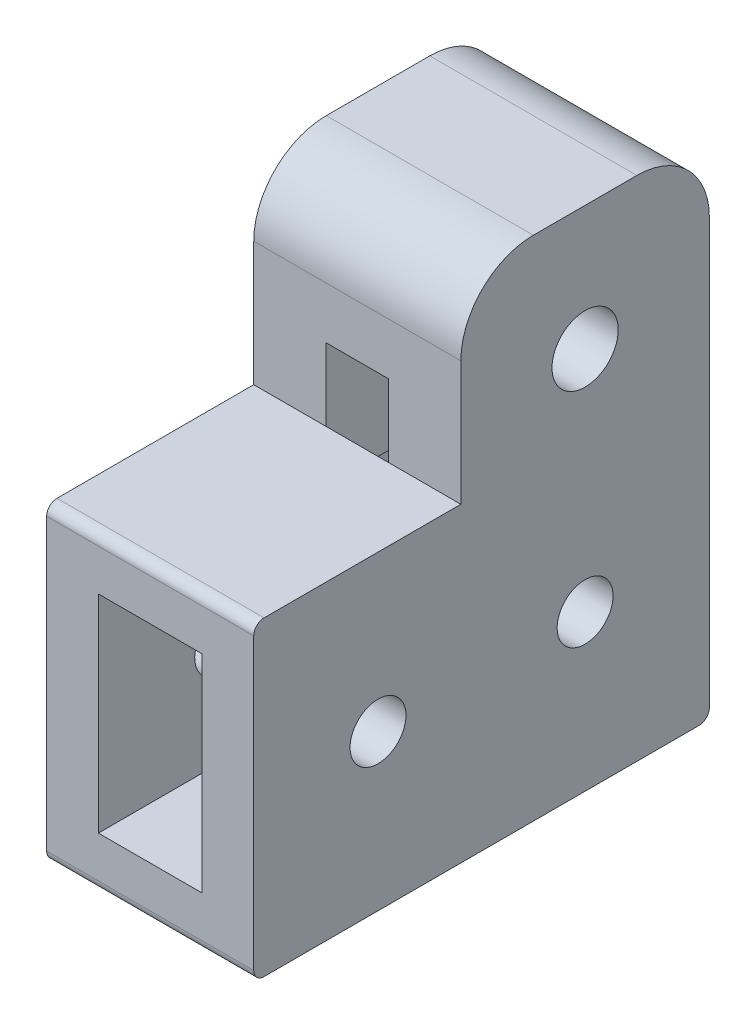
ISO-10303-21;
HEADER;
FILE_DESCRIPTION(('STEP AP214'),'2;1');
FILE_NAME('part.step','',(''),(''),'','','');
FILE_SCHEMA(('AUTOMOTIVE_DESIGN { 1 0 10303 214 1 1 1 1 }'));
ENDSEC;
DATA;
#1=APPLICATION_CONTEXT('core data for automotive mechanical design processes');
#2=APPLICATION_PROTOCOL_DEFINITION('international standard','automotive_design',2000,#1);
#3=PRODUCT_CONTEXT('',#1,'mechanical');
#4=PRODUCT('Part','Part','',(#3));
#5=PRODUCT_RELATED_PRODUCT_CATEGORY('part','',(#4));
#6=PRODUCT_DEFINITION_FORMATION('','',#4);
#7=PRODUCT_DEFINITION_CONTEXT('part definition',#1,'design');
#8=PRODUCT_DEFINITION('design','',#6,#7);
#9=PRODUCT_DEFINITION_SHAPE('','',#8);
#10=(LENGTH_UNIT() NAMED_UNIT(*) SI_UNIT(.MILLI.,.METRE.));
#11=(NAMED_UNIT(*) PLANE_ANGLE_UNIT() SI_UNIT($,.RADIAN.));
#12=(NAMED_UNIT(*) SI_UNIT($,.STERADIAN.) SOLID_ANGLE_UNIT());
#13=UNCERTAINTY_MEASURE_WITH_UNIT(LENGTH_MEASURE(1.E-05),#10,'distance_accuracy_value','');
#14=(GEOMETRIC_REPRESENTATION_CONTEXT(3) GLOBAL_UNCERTAINTY_ASSIGNED_CONTEXT((#13)) GLOBAL_UNIT_ASSIGNED_CONTEXT((#10,
#11,#12)) REPRESENTATION_CONTEXT('',''));
#15=CARTESIAN_POINT('',(0.,0.,0.));
#16=DIRECTION('',(0.,0.,1.));
#17=DIRECTION('',(1.,0.,0.));
#18=AXIS2_PLACEMENT_3D('',#15,#16,#17);
#19=CARTESIAN_POINT('',(10.,-23.,-24.));
#20=DIRECTION('',(0.,0.,1.));
#21=DIRECTION('',(1.,0.,0.));
#22=AXIS2_PLACEMENT_3D('',#19,#20,#21);
#23=PLANE('',#22);
#24=DIRECTION('',(0.,1.,0.));
#25=VECTOR('',#24,1.);
#26=CARTESIAN_POINT('',(10.,-23.,-24.));
#27=LINE('',#26,#25);
#28=CARTESIAN_POINT('',(10.,-22.,-24.));
#29=VERTEX_POINT('',#28);
#30=CARTESIAN_POINT('',(10.,19.,-24.));
#31=VERTEX_POINT('',#30);
#32=EDGE_CURVE('E582',#29,#31,#27,.T.);
#33=ORIENTED_EDGE('',*,*,#32,.F.);
#34=DIRECTION('',(-1.,0.,0.));
#35=VECTOR('',#34,1.);
#36=CARTESIAN_POINT('',(10.,-22.,-24.));
#37=LINE('',#36,#35);
#38=CARTESIAN_POINT('',(-10.,-22.,-24.));
#39=VERTEX_POINT('',#38);
#40=EDGE_CURVE('E355',#29,#39,#37,.T.);
#41=ORIENTED_EDGE('',*,*,#40,.T.);
#42=DIRECTION('',(0.,1.,0.));
#43=VECTOR('',#42,1.);
#44=CARTESIAN_POINT('',(-10.,-23.,-24.));
#45=LINE('',#44,#43);
#46=CARTESIAN_POINT('',(-10.,19.,-24.));
#47=VERTEX_POINT('',#46);
#48=EDGE_CURVE('E414',#39,#47,#45,.T.);
#49=ORIENTED_EDGE('',*,*,#48,.T.);
#50=DIRECTION('',(-1.,0.,0.));
#51=VECTOR('',#50,1.);
#52=CARTESIAN_POINT('',(10.,19.,-24.));
#53=LINE('',#52,#51);
#54=EDGE_CURVE('E338',#47,#31,#53,.F.);
#55=ORIENTED_EDGE('',*,*,#54,.T.);
#56=EDGE_LOOP('',(#33,#41,#49,#55));
#57=FACE_BOUND('',#56,.T.);
#58=DIRECTION('',(0.,1.,0.));
#59=VECTOR('',#58,1.);
#60=CARTESIAN_POINT('',(-5.,-18.,-24.));
#61=LINE('',#60,#59);
#62=CARTESIAN_POINT('',(-5.,-18.,-24.));
#63=VERTEX_POINT('',#62);
#64=CARTESIAN_POINT('',(-5.,1.99999999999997,-24.));
#65=VERTEX_POINT('',#64);
#66=EDGE_CURVE('E223',#63,#65,#61,.T.);
#67=ORIENTED_EDGE('',*,*,#66,.F.);
#68=DIRECTION('',(-1.,0.,0.));
#69=VECTOR('',#68,1.);
#70=CARTESIAN_POINT('',(-3.,-18.,-24.));
#71=LINE('',#70,#69);
#72=CARTESIAN_POINT('',(5.,-18.,-24.));
#73=VERTEX_POINT('',#72);
#74=EDGE_CURVE('E277',#73,#63,#71,.T.);
#75=ORIENTED_EDGE('',*,*,#74,.F.);
#76=DIRECTION('',(0.,-1.,0.));
#77=VECTOR('',#76,1.);
#78=CARTESIAN_POINT('',(5.,-18.,-24.));
#79=LINE('',#78,#77);
#80=CARTESIAN_POINT('',(5.,1.99999999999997,-24.));
#81=VERTEX_POINT('',#80);
#82=EDGE_CURVE('E193',#81,#73,#79,.T.);
#83=ORIENTED_EDGE('',*,*,#82,.F.);
#84=DIRECTION('',(1.,0.,0.));
#85=VECTOR('',#84,1.);
#86=CARTESIAN_POINT('',(-5.,1.99999999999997,-24.));
#87=LINE('',#86,#85);
#88=CARTESIAN_POINT('',(3.,1.99999999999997,-24.));
#89=VERTEX_POINT('',#88);
#90=EDGE_CURVE('E216',#89,#81,#87,.T.);
#91=ORIENTED_EDGE('',*,*,#90,.F.);
#92=DIRECTION('',(1.,0.,0.));
#93=VECTOR('',#92,1.);
#94=CARTESIAN_POINT('',(-3.,1.99999999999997,-24.));
#95=LINE('',#94,#93);
#96=CARTESIAN_POINT('',(-3.,1.99999999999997,-24.));
#97=VERTEX_POINT('',#96);
#98=EDGE_CURVE('E269',#97,#89,#95,.T.);
#99=ORIENTED_EDGE('',*,*,#98,.F.);
#100=EDGE_CURVE('E212',#65,#97,#87,.T.);
#101=ORIENTED_EDGE('',*,*,#100,.F.);
#102=EDGE_LOOP('',(#67,#75,#83,#91,#99,#101));
#103=FACE_BOUND('',#102,.T.);
#104=ADVANCED_FACE('F52',(#57,#103),#23,.F.);
#105=CARTESIAN_POINT('',(10.,-8.00000000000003,-12.));
#106=DIRECTION('',(-1.,0.,0.));
#107=DIRECTION('',(0.,0.,1.));
#108=AXIS2_PLACEMENT_3D('',#105,#106,#107);
#109=CYLINDRICAL_SURFACE('',#108,2.7);
#110=CARTESIAN_POINT('',(5.,-8.00000000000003,-12.));
#111=DIRECTION('',(1.,0.,0.));
#112=DIRECTION('',(0.,1.,0.));
#113=AXIS2_PLACEMENT_3D('',#110,#111,#112);
#114=CIRCLE('',#113,2.7);
#115=CARTESIAN_POINT('',(5.,-5.30000000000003,-12.));
#116=VERTEX_POINT('',#115);
#117=EDGE_CURVE('E264',#116,#116,#114,.T.);
#118=ORIENTED_EDGE('',*,*,#117,.F.);
#119=EDGE_LOOP('',(#118));
#120=FACE_BOUND('',#119,.T.);
#121=CARTESIAN_POINT('',(10.,-8.00000000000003,-12.));
#122=DIRECTION('',(1.,0.,0.));
#123=DIRECTION('',(0.,0.,-1.));
#124=AXIS2_PLACEMENT_3D('',#121,#122,#123);
#125=CIRCLE('',#124,2.7);
#126=CARTESIAN_POINT('',(10.,-8.00000000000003,-14.7));
#127=VERTEX_POINT('',#126);
#128=EDGE_CURVE('E797',#127,#127,#125,.T.);
#129=ORIENTED_EDGE('',*,*,#128,.T.);
#130=EDGE_LOOP('',(#129));
#131=FACE_BOUND('',#130,.T.);
#132=ADVANCED_FACE('F474',(#120,#131),#109,.F.);
#133=CARTESIAN_POINT('',(10.,-8.00000000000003,8.));
#134=DIRECTION('',(-1.,0.,0.));
#135=DIRECTION('',(0.,0.,1.));
#136=AXIS2_PLACEMENT_3D('',#133,#134,#135);
#137=CYLINDRICAL_SURFACE('',#136,2.7);
#138=CARTESIAN_POINT('',(5.,-8.00000000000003,8.));
#139=DIRECTION('',(1.,0.,0.));
#140=DIRECTION('',(0.,1.,0.));
#141=AXIS2_PLACEMENT_3D('',#138,#139,#140);
#142=CIRCLE('',#141,2.7);
#143=CARTESIAN_POINT('',(5.,-5.30000000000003,8.));
#144=VERTEX_POINT('',#143);
#145=EDGE_CURVE('E262',#144,#144,#142,.T.);
#146=ORIENTED_EDGE('',*,*,#145,.F.);
#147=EDGE_LOOP('',(#146));
#148=FACE_BOUND('',#147,.T.);
#149=CARTESIAN_POINT('',(10.,-8.00000000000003,8.));
#150=DIRECTION('',(1.,0.,0.));
#151=DIRECTION('',(0.,0.,-1.));
#152=AXIS2_PLACEMENT_3D('',#149,#150,#151);
#153=CIRCLE('',#152,2.7);
#154=CARTESIAN_POINT('',(10.,-8.00000000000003,5.3));
#155=VERTEX_POINT('',#154);
#156=EDGE_CURVE('E407',#155,#155,#153,.T.);
#157=ORIENTED_EDGE('',*,*,#156,.T.);
#158=EDGE_LOOP('',(#157));
#159=FACE_BOUND('',#158,.T.);
#160=ADVANCED_FACE('F465',(#148,#159),#137,.F.);
#161=CARTESIAN_POINT('',(10.,26.,0.));
#162=DIRECTION('',(0.,0.,-1.));
#163=DIRECTION('',(0.,1.,0.));
#164=AXIS2_PLACEMENT_3D('',#161,#162,#163);
#165=PLANE('',#164);
#166=DIRECTION('',(0.,-1.,0.));
#167=VECTOR('',#166,1.);
#168=CARTESIAN_POINT('',(10.,26.,0.));
#169=LINE('',#168,#167);
#170=CARTESIAN_POINT('',(10.,19.,0.));
#171=VERTEX_POINT('',#170);
#172=CARTESIAN_POINT('',(10.,6.99999999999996,0.));
#173=VERTEX_POINT('',#172);
#174=EDGE_CURVE('E595',#171,#173,#169,.T.);
#175=ORIENTED_EDGE('',*,*,#174,.F.);
#176=DIRECTION('',(-1.,0.,0.));
#177=VECTOR('',#176,1.);
#178=CARTESIAN_POINT('',(10.,19.,0.));
#179=LINE('',#178,#177);
#180=CARTESIAN_POINT('',(-10.,19.,0.));
#181=VERTEX_POINT('',#180);
#182=EDGE_CURVE('E278',#171,#181,#179,.T.);
#183=ORIENTED_EDGE('',*,*,#182,.T.);
#184=DIRECTION('',(0.,-1.,0.));
#185=VECTOR('',#184,1.);
#186=CARTESIAN_POINT('',(-10.,26.,0.));
#187=LINE('',#186,#185);
#188=CARTESIAN_POINT('',(-10.,6.99999999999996,0.));
#189=VERTEX_POINT('',#188);
#190=EDGE_CURVE('E426',#181,#189,#187,.T.);
#191=ORIENTED_EDGE('',*,*,#190,.T.);
#192=DIRECTION('',(-1.,0.,0.));
#193=VECTOR('',#192,1.);
#194=CARTESIAN_POINT('',(10.,6.99999999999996,0.));
#195=LINE('',#194,#193);
#196=CARTESIAN_POINT('',(-3.,6.99999999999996,0.));
#197=VERTEX_POINT('',#196);
#198=EDGE_CURVE('E438',#197,#189,#195,.T.);
#199=ORIENTED_EDGE('',*,*,#198,.F.);
#200=DIRECTION('',(0.,-1.,0.));
#201=VECTOR('',#200,1.);
#202=CARTESIAN_POINT('',(-3.,14.,0.));
#203=LINE('',#202,#201);
#204=CARTESIAN_POINT('',(-3.,14.,0.));
#205=VERTEX_POINT('',#204);
#206=EDGE_CURVE('E315',#205,#197,#203,.T.);
#207=ORIENTED_EDGE('',*,*,#206,.F.);
#208=DIRECTION('',(-1.,0.,0.));
#209=VECTOR('',#208,1.);
#210=CARTESIAN_POINT('',(-3.,14.,0.));
#211=LINE('',#210,#209);
#212=CARTESIAN_POINT('',(3.,14.,0.));
#213=VERTEX_POINT('',#212);
#214=EDGE_CURVE('E310',#213,#205,#211,.T.);
#215=ORIENTED_EDGE('',*,*,#214,.F.);
#216=DIRECTION('',(0.,1.,0.));
#217=VECTOR('',#216,1.);
#218=CARTESIAN_POINT('',(3.,14.,0.));
#219=LINE('',#218,#217);
#220=CARTESIAN_POINT('',(3.,6.99999999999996,0.));
#221=VERTEX_POINT('',#220);
#222=EDGE_CURVE('E323',#221,#213,#219,.T.);
#223=ORIENTED_EDGE('',*,*,#222,.F.);
#224=EDGE_CURVE('E328',#173,#221,#195,.T.);
#225=ORIENTED_EDGE('',*,*,#224,.F.);
#226=EDGE_LOOP('',(#175,#183,#191,#199,#207,#215,#223,#225));
#227=FACE_BOUND('',#226,.T.);
#228=ADVANCED_FACE('F455',(#227),#165,.F.);
#229=CARTESIAN_POINT('',(-5.,-8.00000000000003,-12.));
#230=DIRECTION('',(-1.,0.,0.));
#231=DIRECTION('',(0.,-1.,0.));
#232=AXIS2_PLACEMENT_3D('',#229,#230,#231);
#233=CIRCLE('',#232,2.7);
#234=CARTESIAN_POINT('',(-5.,-10.7,-12.));
#235=VERTEX_POINT('',#234);
#236=EDGE_CURVE('E257',#235,#235,#233,.T.);
#237=ORIENTED_EDGE('',*,*,#236,.F.);
#238=EDGE_LOOP('',(#237));
#239=FACE_BOUND('',#238,.T.);
#240=CARTESIAN_POINT('',(-10.,-8.00000000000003,-12.));
#241=DIRECTION('',(1.,0.,0.));
#242=DIRECTION('',(0.,0.,-1.));
#243=AXIS2_PLACEMENT_3D('',#240,#241,#242);
#244=CIRCLE('',#243,2.7);
#245=CARTESIAN_POINT('',(-10.,-8.00000000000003,-14.7));
#246=VERTEX_POINT('',#245);
#247=EDGE_CURVE('E794',#246,#246,#244,.T.);
#248=ORIENTED_EDGE('',*,*,#247,.F.);
#249=EDGE_LOOP('',(#248));
#250=FACE_BOUND('',#249,.T.);
#251=ADVANCED_FACE('F464',(#239,#250),#109,.F.);
#252=CARTESIAN_POINT('',(10.,0.,0.));
#253=DIRECTION('',(1.,0.,0.));
#254=DIRECTION('',(0.,0.,-1.));
#255=AXIS2_PLACEMENT_3D('',#252,#253,#254);
#256=PLANE('',#255);
#257=ORIENTED_EDGE('',*,*,#128,.F.);
#258=EDGE_LOOP('',(#257));
#259=FACE_BOUND('',#258,.T.);
#260=DIRECTION('',(0.,0.,-1.));
#261=VECTOR('',#260,1.);
#262=CARTESIAN_POINT('',(10.,-23.,20.));
#263=LINE('',#262,#261);
#264=CARTESIAN_POINT('',(10.,-23.,19.));
#265=VERTEX_POINT('',#264);
#266=CARTESIAN_POINT('',(10.,-23.,-23.));
#267=VERTEX_POINT('',#266);
#268=EDGE_CURVE('E576',#265,#267,#263,.T.);
#269=ORIENTED_EDGE('',*,*,#268,.T.);
#270=CARTESIAN_POINT('',(10.,-22.,-23.));
#271=DIRECTION('',(1.,0.,0.));
#272=DIRECTION('',(0.,0.,-1.));
#273=AXIS2_PLACEMENT_3D('',#270,#271,#272);
#274=CIRCLE('',#273,1.);
#275=EDGE_CURVE('E387',#267,#29,#274,.T.);
#276=ORIENTED_EDGE('',*,*,#275,.T.);
#277=ORIENTED_EDGE('',*,*,#32,.T.);
#278=CARTESIAN_POINT('',(10.,19.,-17.));
#279=DIRECTION('',(1.,0.,0.));
#280=DIRECTION('',(0.,0.,-1.));
#281=AXIS2_PLACEMENT_3D('',#278,#279,#280);
#282=CIRCLE('',#281,7.);
#283=CARTESIAN_POINT('',(10.,26.,-17.));
#284=VERTEX_POINT('',#283);
#285=EDGE_CURVE('E346',#31,#284,#282,.T.);
#286=ORIENTED_EDGE('',*,*,#285,.T.);
#287=DIRECTION('',(0.,0.,1.));
#288=VECTOR('',#287,1.);
#289=CARTESIAN_POINT('',(10.,26.,-24.));
#290=LINE('',#289,#288);
#291=CARTESIAN_POINT('',(10.,26.,-7.));
#292=VERTEX_POINT('',#291);
#293=EDGE_CURVE('E587',#284,#292,#290,.T.);
#294=ORIENTED_EDGE('',*,*,#293,.T.);
#295=CARTESIAN_POINT('',(10.,19.,-7.));
#296=DIRECTION('',(1.,0.,0.));
#297=DIRECTION('',(0.,0.,-1.));
#298=AXIS2_PLACEMENT_3D('',#295,#296,#297);
#299=CIRCLE('',#298,7.);
#300=EDGE_CURVE('E343',#292,#171,#299,.T.);
#301=ORIENTED_EDGE('',*,*,#300,.T.);
#302=ORIENTED_EDGE('',*,*,#174,.T.);
#303=DIRECTION('',(0.,0.,1.));
#304=VECTOR('',#303,1.);
#305=CARTESIAN_POINT('',(10.,6.99999999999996,0.));
#306=LINE('',#305,#304);
#307=CARTESIAN_POINT('',(10.,6.99999999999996,19.));
#308=VERTEX_POINT('',#307);
#309=EDGE_CURVE('E416',#173,#308,#306,.T.);
#310=ORIENTED_EDGE('',*,*,#309,.T.);
#311=CARTESIAN_POINT('',(10.,5.99999999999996,19.));
#312=DIRECTION('',(1.,0.,0.));
#313=DIRECTION('',(0.,0.,-1.));
#314=AXIS2_PLACEMENT_3D('',#311,#312,#313);
#315=CIRCLE('',#314,1.);
#316=CARTESIAN_POINT('',(10.,5.99999999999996,20.));
#317=VERTEX_POINT('',#316);
#318=EDGE_CURVE('E73',#308,#317,#315,.T.);
#319=ORIENTED_EDGE('',*,*,#318,.T.);
#320=DIRECTION('',(0.,-1.,0.));
#321=VECTOR('',#320,1.);
#322=CARTESIAN_POINT('',(10.,6.99999999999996,20.));
#323=LINE('',#322,#321);
#324=CARTESIAN_POINT('',(10.,-22.,20.));
#325=VERTEX_POINT('',#324);
#326=EDGE_CURVE('E400',#317,#325,#323,.T.);
#327=ORIENTED_EDGE('',*,*,#326,.T.);
#328=CARTESIAN_POINT('',(10.,-22.,19.));
#329=DIRECTION('',(1.,0.,0.));
#330=DIRECTION('',(0.,0.,-1.));
#331=AXIS2_PLACEMENT_3D('',#328,#329,#330);
#332=CIRCLE('',#331,1.);
#333=EDGE_CURVE('E383',#325,#265,#332,.T.);
#334=ORIENTED_EDGE('',*,*,#333,.T.);
#335=EDGE_LOOP('',(#269,#276,#277,#286,#294,#301,#302,#310,#319,#327,#334));
#336=FACE_BOUND('',#335,.T.);
#337=ORIENTED_EDGE('',*,*,#156,.F.);
#338=EDGE_LOOP('',(#337));
#339=FACE_BOUND('',#338,.T.);
#340=CARTESIAN_POINT('',(10.,14.,-12.));
#341=DIRECTION('',(1.,0.,0.));
#342=DIRECTION('',(0.,0.,-1.));
#343=AXIS2_PLACEMENT_3D('',#340,#341,#342);
#344=CIRCLE('',#343,3.2);
#345=CARTESIAN_POINT('',(10.,14.,-15.2));
#346=VERTEX_POINT('',#345);
#347=EDGE_CURVE('E795',#346,#346,#344,.T.);
#348=ORIENTED_EDGE('',*,*,#347,.F.);
#349=EDGE_LOOP('',(#348));
#350=FACE_BOUND('',#349,.T.);
#351=ADVANCED_FACE('F542',(#259,#336,#339,#350),#256,.T.);
#352=CARTESIAN_POINT('',(-10.,0.,0.));
#353=DIRECTION('',(1.,0.,0.));
#354=DIRECTION('',(0.,0.,-1.));
#355=AXIS2_PLACEMENT_3D('',#352,#353,#354);
#356=PLANE('',#355);
#357=ORIENTED_EDGE('',*,*,#48,.F.);
#358=CARTESIAN_POINT('',(-10.,-22.,-23.));
#359=DIRECTION('',(1.,0.,0.));
#360=DIRECTION('',(0.,0.,-1.));
#361=AXIS2_PLACEMENT_3D('',#358,#359,#360);
#362=CIRCLE('',#361,1.);
#363=CARTESIAN_POINT('',(-10.,-23.,-23.));
#364=VERTEX_POINT('',#363);
#365=EDGE_CURVE('E373',#39,#364,#362,.F.);
#366=ORIENTED_EDGE('',*,*,#365,.T.);
#367=DIRECTION('',(0.,0.,-1.));
#368=VECTOR('',#367,1.);
#369=CARTESIAN_POINT('',(-10.,-23.,20.));
#370=LINE('',#369,#368);
#371=CARTESIAN_POINT('',(-10.,-23.,19.));
#372=VERTEX_POINT('',#371);
#373=EDGE_CURVE('E410',#372,#364,#370,.T.);
#374=ORIENTED_EDGE('',*,*,#373,.F.);
#375=CARTESIAN_POINT('',(-10.,-22.,19.));
#376=DIRECTION('',(1.,0.,0.));
#377=DIRECTION('',(0.,0.,-1.));
#378=AXIS2_PLACEMENT_3D('',#375,#376,#377);
#379=CIRCLE('',#378,1.);
#380=CARTESIAN_POINT('',(-10.,-22.,20.));
#381=VERTEX_POINT('',#380);
#382=EDGE_CURVE('E370',#372,#381,#379,.F.);
#383=ORIENTED_EDGE('',*,*,#382,.T.);
#384=DIRECTION('',(0.,-1.,0.));
#385=VECTOR('',#384,1.);
#386=CARTESIAN_POINT('',(-10.,6.99999999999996,20.));
#387=LINE('',#386,#385);
#388=CARTESIAN_POINT('',(-10.,5.99999999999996,20.));
#389=VERTEX_POINT('',#388);
#390=EDGE_CURVE('E399',#389,#381,#387,.T.);
#391=ORIENTED_EDGE('',*,*,#390,.F.);
#392=CARTESIAN_POINT('',(-10.,5.99999999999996,19.));
#393=DIRECTION('',(1.,0.,0.));
#394=DIRECTION('',(0.,0.,-1.));
#395=AXIS2_PLACEMENT_3D('',#392,#393,#394);
#396=CIRCLE('',#395,1.);
#397=CARTESIAN_POINT('',(-10.,6.99999999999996,19.));
#398=VERTEX_POINT('',#397);
#399=EDGE_CURVE('E359',#389,#398,#396,.F.);
#400=ORIENTED_EDGE('',*,*,#399,.T.);
#401=DIRECTION('',(0.,0.,1.));
#402=VECTOR('',#401,1.);
#403=CARTESIAN_POINT('',(-10.,6.99999999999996,0.));
#404=LINE('',#403,#402);
#405=EDGE_CURVE('E431',#189,#398,#404,.T.);
#406=ORIENTED_EDGE('',*,*,#405,.F.);
#407=ORIENTED_EDGE('',*,*,#190,.F.);
#408=CARTESIAN_POINT('',(-10.,19.,-7.));
#409=DIRECTION('',(1.,0.,0.));
#410=DIRECTION('',(0.,0.,-1.));
#411=AXIS2_PLACEMENT_3D('',#408,#409,#410);
#412=CIRCLE('',#411,7.);
#413=CARTESIAN_POINT('',(-10.,26.,-7.));
#414=VERTEX_POINT('',#413);
#415=EDGE_CURVE('E335',#181,#414,#412,.F.);
#416=ORIENTED_EDGE('',*,*,#415,.T.);
#417=DIRECTION('',(0.,0.,1.));
#418=VECTOR('',#417,1.);
#419=CARTESIAN_POINT('',(-10.,26.,-24.));
#420=LINE('',#419,#418);
#421=CARTESIAN_POINT('',(-10.,26.,-17.));
#422=VERTEX_POINT('',#421);
#423=EDGE_CURVE('E425',#422,#414,#420,.T.);
#424=ORIENTED_EDGE('',*,*,#423,.F.);
#425=CARTESIAN_POINT('',(-10.,19.,-17.));
#426=DIRECTION('',(1.,0.,0.));
#427=DIRECTION('',(0.,0.,-1.));
#428=AXIS2_PLACEMENT_3D('',#425,#426,#427);
#429=CIRCLE('',#428,7.);
#430=EDGE_CURVE('E337',#422,#47,#429,.F.);
#431=ORIENTED_EDGE('',*,*,#430,.T.);
#432=EDGE_LOOP('',(#357,#366,#374,#383,#391,#400,#406,#407,#416,#424,#431));
#433=FACE_BOUND('',#432,.T.);
#434=CARTESIAN_POINT('',(-10.,-8.00000000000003,8.));
#435=DIRECTION('',(1.,0.,0.));
#436=DIRECTION('',(0.,0.,-1.));
#437=AXIS2_PLACEMENT_3D('',#434,#435,#436);
#438=CIRCLE('',#437,2.7);
#439=CARTESIAN_POINT('',(-10.,-8.00000000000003,5.3));
#440=VERTEX_POINT('',#439);
#441=EDGE_CURVE('E417',#440,#440,#438,.T.);
#442=ORIENTED_EDGE('',*,*,#441,.T.);
#443=EDGE_LOOP('',(#442));
#444=FACE_BOUND('',#443,.T.);
#445=ORIENTED_EDGE('',*,*,#247,.T.);
#446=EDGE_LOOP('',(#445));
#447=FACE_BOUND('',#446,.T.);
#448=CARTESIAN_POINT('',(-10.,14.,-12.));
#449=DIRECTION('',(1.,0.,0.));
#450=DIRECTION('',(0.,0.,-1.));
#451=AXIS2_PLACEMENT_3D('',#448,#449,#450);
#452=CIRCLE('',#451,3.2);
#453=CARTESIAN_POINT('',(-10.,14.,-15.2));
#454=VERTEX_POINT('',#453);
#455=EDGE_CURVE('E311',#454,#454,#452,.T.);
#456=ORIENTED_EDGE('',*,*,#455,.T.);
#457=EDGE_LOOP('',(#456));
#458=FACE_BOUND('',#457,.T.);
#459=ADVANCED_FACE('F402',(#433,#444,#447,#458),#356,.F.);
#460=CARTESIAN_POINT('',(10.,6.99999999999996,20.));
#461=DIRECTION('',(0.,0.,-1.));
#462=DIRECTION('',(0.,1.,0.));
#463=AXIS2_PLACEMENT_3D('',#460,#461,#462);
#464=PLANE('',#463);
#465=DIRECTION('',(1.,0.,0.));
#466=VECTOR('',#465,1.);
#467=CARTESIAN_POINT('',(-5.,1.99999999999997,20.));
#468=LINE('',#467,#466);
#469=CARTESIAN_POINT('',(-5.,1.99999999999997,20.));
#470=VERTEX_POINT('',#469);
#471=CARTESIAN_POINT('',(5.,1.99999999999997,20.));
#472=VERTEX_POINT('',#471);
#473=EDGE_CURVE('E199',#470,#472,#468,.T.);
#474=ORIENTED_EDGE('',*,*,#473,.T.);
#475=DIRECTION('',(0.,-1.,0.));
#476=VECTOR('',#475,1.);
#477=CARTESIAN_POINT('',(5.,-18.,20.));
#478=LINE('',#477,#476);
#479=CARTESIAN_POINT('',(5.,-18.,20.));
#480=VERTEX_POINT('',#479);
#481=EDGE_CURVE('E191',#472,#480,#478,.T.);
#482=ORIENTED_EDGE('',*,*,#481,.T.);
#483=DIRECTION('',(-1.,0.,0.));
#484=VECTOR('',#483,1.);
#485=CARTESIAN_POINT('',(-5.,-18.,20.));
#486=LINE('',#485,#484);
#487=CARTESIAN_POINT('',(-5.,-18.,20.));
#488=VERTEX_POINT('',#487);
#489=EDGE_CURVE('E204',#480,#488,#486,.T.);
#490=ORIENTED_EDGE('',*,*,#489,.T.);
#491=DIRECTION('',(0.,1.,0.));
#492=VECTOR('',#491,1.);
#493=CARTESIAN_POINT('',(-5.,-18.,20.));
#494=LINE('',#493,#492);
#495=EDGE_CURVE('E206',#488,#470,#494,.T.);
#496=ORIENTED_EDGE('',*,*,#495,.T.);
#497=EDGE_LOOP('',(#474,#482,#490,#496));
#498=FACE_BOUND('',#497,.T.);
#499=ORIENTED_EDGE('',*,*,#390,.T.);
#500=DIRECTION('',(-1.,0.,0.));
#501=VECTOR('',#500,1.);
#502=CARTESIAN_POINT('',(10.,-22.,20.));
#503=LINE('',#502,#501);
#504=EDGE_CURVE('E65',#381,#325,#503,.F.);
#505=ORIENTED_EDGE('',*,*,#504,.T.);
#506=ORIENTED_EDGE('',*,*,#326,.F.);
#507=DIRECTION('',(-1.,0.,0.));
#508=VECTOR('',#507,1.);
#509=CARTESIAN_POINT('',(10.,5.99999999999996,20.));
#510=LINE('',#509,#508);
#511=EDGE_CURVE('E391',#317,#389,#510,.T.);
#512=ORIENTED_EDGE('',*,*,#511,.T.);
#513=EDGE_LOOP('',(#499,#505,#506,#512));
#514=FACE_BOUND('',#513,.T.);
#515=ADVANCED_FACE('F208',(#498,#514),#464,.F.);
#516=CARTESIAN_POINT('',(10.,-23.,20.));
#517=DIRECTION('',(0.,1.,0.));
#518=DIRECTION('',(0.,0.,1.));
#519=AXIS2_PLACEMENT_3D('',#516,#517,#518);
#520=PLANE('',#519);
#521=ORIENTED_EDGE('',*,*,#373,.T.);
#522=DIRECTION('',(-1.,0.,0.));
#523=VECTOR('',#522,1.);
#524=CARTESIAN_POINT('',(10.,-23.,-23.));
#525=LINE('',#524,#523);
#526=EDGE_CURVE('E379',#364,#267,#525,.F.);
#527=ORIENTED_EDGE('',*,*,#526,.T.);
#528=ORIENTED_EDGE('',*,*,#268,.F.);
#529=DIRECTION('',(-1.,0.,0.));
#530=VECTOR('',#529,1.);
#531=CARTESIAN_POINT('',(10.,-23.,19.));
#532=LINE('',#531,#530);
#533=EDGE_CURVE('E376',#265,#372,#532,.T.);
#534=ORIENTED_EDGE('',*,*,#533,.T.);
#535=EDGE_LOOP('',(#521,#527,#528,#534));
#536=FACE_BOUND('',#535,.T.);
#537=ADVANCED_FACE('F468',(#536),#520,.F.);
#538=CARTESIAN_POINT('',(10.,26.,-24.));
#539=DIRECTION('',(0.,-1.,0.));
#540=DIRECTION('',(0.,0.,-1.));
#541=AXIS2_PLACEMENT_3D('',#538,#539,#540);
#542=PLANE('',#541);
#543=ORIENTED_EDGE('',*,*,#293,.F.);
#544=DIRECTION('',(-1.,0.,0.));
#545=VECTOR('',#544,1.);
#546=CARTESIAN_POINT('',(10.,26.,-17.));
#547=LINE('',#546,#545);
#548=EDGE_CURVE('E329',#284,#422,#547,.T.);
#549=ORIENTED_EDGE('',*,*,#548,.T.);
#550=ORIENTED_EDGE('',*,*,#423,.T.);
#551=DIRECTION('',(-1.,0.,0.));
#552=VECTOR('',#551,1.);
#553=CARTESIAN_POINT('',(10.,26.,-7.));
#554=LINE('',#553,#552);
#555=EDGE_CURVE('E324',#414,#292,#554,.F.);
#556=ORIENTED_EDGE('',*,*,#555,.T.);
#557=EDGE_LOOP('',(#543,#549,#550,#556));
#558=FACE_BOUND('',#557,.T.);
#559=ADVANCED_FACE('F470',(#558),#542,.F.);
#560=CARTESIAN_POINT('',(10.,6.99999999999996,0.));
#561=DIRECTION('',(0.,-1.,0.));
#562=DIRECTION('',(0.,0.,-1.));
#563=AXIS2_PLACEMENT_3D('',#560,#561,#562);
#564=PLANE('',#563);
#565=ORIENTED_EDGE('',*,*,#405,.T.);
#566=DIRECTION('',(-1.,0.,0.));
#567=VECTOR('',#566,1.);
#568=CARTESIAN_POINT('',(10.,6.99999999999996,19.));
#569=LINE('',#568,#567);
#570=EDGE_CURVE('E12',#398,#308,#569,.F.);
#571=ORIENTED_EDGE('',*,*,#570,.T.);
#572=ORIENTED_EDGE('',*,*,#309,.F.);
#573=ORIENTED_EDGE('',*,*,#224,.T.);
#574=DIRECTION('',(1.,0.,0.));
#575=VECTOR('',#574,1.);
#576=CARTESIAN_POINT('',(-3.,6.99999999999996,0.));
#577=LINE('',#576,#575);
#578=EDGE_CURVE('E319',#197,#221,#577,.T.);
#579=ORIENTED_EDGE('',*,*,#578,.F.);
#580=ORIENTED_EDGE('',*,*,#198,.T.);
#581=EDGE_LOOP('',(#565,#571,#572,#573,#579,#580));
#582=FACE_BOUND('',#581,.T.);
#583=ADVANCED_FACE('F461',(#582),#564,.F.);
#584=CARTESIAN_POINT('',(-5.,-8.00000000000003,8.));
#585=DIRECTION('',(-1.,0.,0.));
#586=DIRECTION('',(0.,-1.,0.));
#587=AXIS2_PLACEMENT_3D('',#584,#585,#586);
#588=CIRCLE('',#587,2.7);
#589=CARTESIAN_POINT('',(-5.,-10.7,8.));
#590=VERTEX_POINT('',#589);
#591=EDGE_CURVE('E253',#590,#590,#588,.T.);
#592=ORIENTED_EDGE('',*,*,#591,.F.);
#593=EDGE_LOOP('',(#592));
#594=FACE_BOUND('',#593,.T.);
#595=ORIENTED_EDGE('',*,*,#441,.F.);
#596=EDGE_LOOP('',(#595));
#597=FACE_BOUND('',#596,.T.);
#598=ADVANCED_FACE('F537',(#594,#597),#137,.F.);
#599=CARTESIAN_POINT('',(10.,14.,-12.));
#600=DIRECTION('',(-1.,0.,0.));
#601=DIRECTION('',(0.,0.,1.));
#602=AXIS2_PLACEMENT_3D('',#599,#600,#601);
#603=CYLINDRICAL_SURFACE('',#602,3.2);
#604=ORIENTED_EDGE('',*,*,#347,.T.);
#605=EDGE_LOOP('',(#604));
#606=FACE_BOUND('',#605,.T.);
#607=ORIENTED_EDGE('',*,*,#455,.F.);
#608=EDGE_LOOP('',(#607));
#609=FACE_BOUND('',#608,.T.);
#610=ADVANCED_FACE('F531',(#606,#609),#603,.F.);
#611=CARTESIAN_POINT('',(0.,3.35720233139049,-3.4970857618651));
#612=DIRECTION('',(0.,0.692531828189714,-0.721387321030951));
#613=DIRECTION('',(0.,0.721387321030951,0.692531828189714));
#614=AXIS2_PLACEMENT_3D('',#611,#612,#613);
#615=PLANE('',#614);
#616=DIRECTION('',(1.,0.,0.));
#617=VECTOR('',#616,1.);
#618=CARTESIAN_POINT('',(0.,1.99999999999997,-4.8));
#619=LINE('',#618,#617);
#620=CARTESIAN_POINT('',(-3.,1.99999999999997,-4.8));
#621=VERTEX_POINT('',#620);
#622=CARTESIAN_POINT('',(3.,1.99999999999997,-4.8));
#623=VERTEX_POINT('',#622);
#624=EDGE_CURVE('E242',#621,#623,#619,.T.);
#625=ORIENTED_EDGE('',*,*,#624,.F.);
#626=DIRECTION('',(0.,0.721387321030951,0.692531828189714));
#627=VECTOR('',#626,1.);
#628=CARTESIAN_POINT('',(-3.,-18.,-24.));
#629=LINE('',#628,#627);
#630=EDGE_CURVE('E280',#621,#197,#629,.T.);
#631=ORIENTED_EDGE('',*,*,#630,.T.);
#632=ORIENTED_EDGE('',*,*,#578,.T.);
#633=DIRECTION('',(0.,0.721387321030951,0.692531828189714));
#634=VECTOR('',#633,1.);
#635=CARTESIAN_POINT('',(3.,-18.,-24.));
#636=LINE('',#635,#634);
#637=EDGE_CURVE('E271',#623,#221,#636,.T.);
#638=ORIENTED_EDGE('',*,*,#637,.F.);
#639=EDGE_LOOP('',(#625,#631,#632,#638));
#640=FACE_BOUND('',#639,.T.);
#641=ADVANCED_FACE('F540',(#640),#615,.T.);
#642=CARTESIAN_POINT('',(-3.,0.,0.));
#643=DIRECTION('',(1.,0.,0.));
#644=DIRECTION('',(0.,0.,-1.));
#645=AXIS2_PLACEMENT_3D('',#642,#643,#644);
#646=PLANE('',#645);
#647=DIRECTION('',(0.,0.,1.));
#648=VECTOR('',#647,1.);
#649=CARTESIAN_POINT('',(-3.,1.99999999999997,0.));
#650=LINE('',#649,#648);
#651=EDGE_CURVE('E247',#97,#621,#650,.T.);
#652=ORIENTED_EDGE('',*,*,#651,.F.);
#653=DIRECTION('',(0.,0.447213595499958,0.894427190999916));
#654=VECTOR('',#653,1.);
#655=CARTESIAN_POINT('',(-3.,1.99999999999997,-24.));
#656=LINE('',#655,#654);
#657=EDGE_CURVE('E498',#97,#205,#656,.T.);
#658=ORIENTED_EDGE('',*,*,#657,.T.);
#659=ORIENTED_EDGE('',*,*,#206,.T.);
#660=ORIENTED_EDGE('',*,*,#630,.F.);
#661=EDGE_LOOP('',(#652,#658,#659,#660));
#662=FACE_BOUND('',#661,.T.);
#663=ADVANCED_FACE('F605',(#662),#646,.T.);
#664=CARTESIAN_POINT('',(3.,0.,0.));
#665=DIRECTION('',(-1.,0.,0.));
#666=DIRECTION('',(0.,-1.,0.));
#667=AXIS2_PLACEMENT_3D('',#664,#665,#666);
#668=PLANE('',#667);
#669=DIRECTION('',(0.,0.,-1.));
#670=VECTOR('',#669,1.);
#671=CARTESIAN_POINT('',(3.,1.99999999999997,0.));
#672=LINE('',#671,#670);
#673=EDGE_CURVE('E245',#623,#89,#672,.T.);
#674=ORIENTED_EDGE('',*,*,#673,.F.);
#675=ORIENTED_EDGE('',*,*,#637,.T.);
#676=ORIENTED_EDGE('',*,*,#222,.T.);
#677=DIRECTION('',(0.,0.447213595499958,0.894427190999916));
#678=VECTOR('',#677,1.);
#679=CARTESIAN_POINT('',(3.,1.99999999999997,-24.));
#680=LINE('',#679,#678);
#681=EDGE_CURVE('E284',#89,#213,#680,.T.);
#682=ORIENTED_EDGE('',*,*,#681,.F.);
#683=EDGE_LOOP('',(#674,#675,#676,#682));
#684=FACE_BOUND('',#683,.T.);
#685=ADVANCED_FACE('F532',(#684),#668,.T.);
#686=CARTESIAN_POINT('',(0.,11.2,-5.59999999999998));
#687=DIRECTION('',(0.,-0.894427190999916,0.447213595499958));
#688=DIRECTION('',(0.,-0.447213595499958,-0.894427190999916));
#689=AXIS2_PLACEMENT_3D('',#686,#687,#688);
#690=PLANE('',#689);
#691=ORIENTED_EDGE('',*,*,#657,.F.);
#692=ORIENTED_EDGE('',*,*,#98,.T.);
#693=ORIENTED_EDGE('',*,*,#681,.T.);
#694=ORIENTED_EDGE('',*,*,#214,.T.);
#695=EDGE_LOOP('',(#691,#692,#693,#694));
#696=FACE_BOUND('',#695,.T.);
#697=ADVANCED_FACE('F519',(#696),#690,.T.);
#698=CARTESIAN_POINT('',(10.,19.,-17.));
#699=DIRECTION('',(-1.,0.,0.));
#700=DIRECTION('',(0.,0.,1.));
#701=AXIS2_PLACEMENT_3D('',#698,#699,#700);
#702=CYLINDRICAL_SURFACE('',#701,7.);
#703=ORIENTED_EDGE('',*,*,#285,.F.);
#704=ORIENTED_EDGE('',*,*,#54,.F.);
#705=ORIENTED_EDGE('',*,*,#430,.F.);
#706=ORIENTED_EDGE('',*,*,#548,.F.);
#707=EDGE_LOOP('',(#703,#704,#705,#706));
#708=FACE_BOUND('',#707,.T.);
#709=ADVANCED_FACE('F528',(#708),#702,.T.);
#710=CARTESIAN_POINT('',(10.,19.,-7.));
#711=DIRECTION('',(-1.,0.,0.));
#712=DIRECTION('',(0.,0.,1.));
#713=AXIS2_PLACEMENT_3D('',#710,#711,#712);
#714=CYLINDRICAL_SURFACE('',#713,7.);
#715=ORIENTED_EDGE('',*,*,#300,.F.);
#716=ORIENTED_EDGE('',*,*,#555,.F.);
#717=ORIENTED_EDGE('',*,*,#415,.F.);
#718=ORIENTED_EDGE('',*,*,#182,.F.);
#719=EDGE_LOOP('',(#715,#716,#717,#718));
#720=FACE_BOUND('',#719,.T.);
#721=ADVANCED_FACE('F557',(#720),#714,.T.);
#722=CARTESIAN_POINT('',(5.,-18.,20.));
#723=DIRECTION('',(1.,0.,0.));
#724=DIRECTION('',(0.,1.,0.));
#725=AXIS2_PLACEMENT_3D('',#722,#723,#724);
#726=PLANE('',#725);
#727=ORIENTED_EDGE('',*,*,#117,.T.);
#728=EDGE_LOOP('',(#727));
#729=FACE_BOUND('',#728,.T.);
#730=ORIENTED_EDGE('',*,*,#145,.T.);
#731=EDGE_LOOP('',(#730));
#732=FACE_BOUND('',#731,.T.);
#733=ORIENTED_EDGE('',*,*,#82,.T.);
#734=DIRECTION('',(0.,0.,-1.));
#735=VECTOR('',#734,1.);
#736=CARTESIAN_POINT('',(5.,-18.,20.));
#737=LINE('',#736,#735);
#738=EDGE_CURVE('E187',#480,#73,#737,.T.);
#739=ORIENTED_EDGE('',*,*,#738,.F.);
#740=ORIENTED_EDGE('',*,*,#481,.F.);
#741=DIRECTION('',(0.,0.,-1.));
#742=VECTOR('',#741,1.);
#743=CARTESIAN_POINT('',(5.,1.99999999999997,20.));
#744=LINE('',#743,#742);
#745=EDGE_CURVE('E233',#472,#81,#744,.T.);
#746=ORIENTED_EDGE('',*,*,#745,.T.);
#747=EDGE_LOOP('',(#733,#739,#740,#746));
#748=FACE_BOUND('',#747,.T.);
#749=ADVANCED_FACE('F189',(#729,#732,#748),#726,.F.);
#750=CARTESIAN_POINT('',(-5.,1.99999999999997,20.));
#751=DIRECTION('',(0.,1.,0.));
#752=DIRECTION('',(0.,0.,1.));
#753=AXIS2_PLACEMENT_3D('',#750,#751,#752);
#754=PLANE('',#753);
#755=ORIENTED_EDGE('',*,*,#651,.T.);
#756=ORIENTED_EDGE('',*,*,#624,.T.);
#757=ORIENTED_EDGE('',*,*,#673,.T.);
#758=ORIENTED_EDGE('',*,*,#90,.T.);
#759=ORIENTED_EDGE('',*,*,#745,.F.);
#760=ORIENTED_EDGE('',*,*,#473,.F.);
#761=DIRECTION('',(0.,0.,-1.));
#762=VECTOR('',#761,1.);
#763=CARTESIAN_POINT('',(-5.,1.99999999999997,20.));
#764=LINE('',#763,#762);
#765=EDGE_CURVE('E238',#470,#65,#764,.T.);
#766=ORIENTED_EDGE('',*,*,#765,.T.);
#767=ORIENTED_EDGE('',*,*,#100,.T.);
#768=EDGE_LOOP('',(#755,#756,#757,#758,#759,#760,#766,#767));
#769=FACE_BOUND('',#768,.T.);
#770=ADVANCED_FACE('F606',(#769),#754,.F.);
#771=CARTESIAN_POINT('',(-5.,-18.,20.));
#772=DIRECTION('',(-1.,0.,0.));
#773=DIRECTION('',(0.,-1.,0.));
#774=AXIS2_PLACEMENT_3D('',#771,#772,#773);
#775=PLANE('',#774);
#776=ORIENTED_EDGE('',*,*,#236,.T.);
#777=EDGE_LOOP('',(#776));
#778=FACE_BOUND('',#777,.T.);
#779=ORIENTED_EDGE('',*,*,#591,.T.);
#780=EDGE_LOOP('',(#779));
#781=FACE_BOUND('',#780,.T.);
#782=ORIENTED_EDGE('',*,*,#66,.T.);
#783=ORIENTED_EDGE('',*,*,#765,.F.);
#784=ORIENTED_EDGE('',*,*,#495,.F.);
#785=DIRECTION('',(0.,0.,-1.));
#786=VECTOR('',#785,1.);
#787=CARTESIAN_POINT('',(-5.,-18.,20.));
#788=LINE('',#787,#786);
#789=EDGE_CURVE('E197',#488,#63,#788,.T.);
#790=ORIENTED_EDGE('',*,*,#789,.T.);
#791=EDGE_LOOP('',(#782,#783,#784,#790));
#792=FACE_BOUND('',#791,.T.);
#793=ADVANCED_FACE('F611',(#778,#781,#792),#775,.F.);
#794=CARTESIAN_POINT('',(-5.,-18.,20.));
#795=DIRECTION('',(0.,-1.,0.));
#796=DIRECTION('',(0.,0.,-1.));
#797=AXIS2_PLACEMENT_3D('',#794,#795,#796);
#798=PLANE('',#797);
#799=ORIENTED_EDGE('',*,*,#738,.T.);
#800=ORIENTED_EDGE('',*,*,#74,.T.);
#801=ORIENTED_EDGE('',*,*,#789,.F.);
#802=ORIENTED_EDGE('',*,*,#489,.F.);
#803=EDGE_LOOP('',(#799,#800,#801,#802));
#804=FACE_BOUND('',#803,.T.);
#805=ADVANCED_FACE('F205',(#804),#798,.F.);
#806=CARTESIAN_POINT('',(10.,-22.,-23.));
#807=DIRECTION('',(-1.,0.,0.));
#808=DIRECTION('',(0.,0.,1.));
#809=AXIS2_PLACEMENT_3D('',#806,#807,#808);
#810=CYLINDRICAL_SURFACE('',#809,1.);
#811=ORIENTED_EDGE('',*,*,#275,.F.);
#812=ORIENTED_EDGE('',*,*,#526,.F.);
#813=ORIENTED_EDGE('',*,*,#365,.F.);
#814=ORIENTED_EDGE('',*,*,#40,.F.);
#815=EDGE_LOOP('',(#811,#812,#813,#814));
#816=FACE_BOUND('',#815,.T.);
#817=ADVANCED_FACE('F564',(#816),#810,.T.);
#818=CARTESIAN_POINT('',(10.,-22.,19.));
#819=DIRECTION('',(-1.,0.,0.));
#820=DIRECTION('',(0.,0.,1.));
#821=AXIS2_PLACEMENT_3D('',#818,#819,#820);
#822=CYLINDRICAL_SURFACE('',#821,1.);
#823=ORIENTED_EDGE('',*,*,#333,.F.);
#824=ORIENTED_EDGE('',*,*,#504,.F.);
#825=ORIENTED_EDGE('',*,*,#382,.F.);
#826=ORIENTED_EDGE('',*,*,#533,.F.);
#827=EDGE_LOOP('',(#823,#824,#825,#826));
#828=FACE_BOUND('',#827,.T.);
#829=ADVANCED_FACE('F570',(#828),#822,.T.);
#830=CARTESIAN_POINT('',(10.,5.99999999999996,19.));
#831=DIRECTION('',(-1.,0.,0.));
#832=DIRECTION('',(0.,0.,1.));
#833=AXIS2_PLACEMENT_3D('',#830,#831,#832);
#834=CYLINDRICAL_SURFACE('',#833,1.);
#835=ORIENTED_EDGE('',*,*,#318,.F.);
#836=ORIENTED_EDGE('',*,*,#570,.F.);
#837=ORIENTED_EDGE('',*,*,#399,.F.);
#838=ORIENTED_EDGE('',*,*,#511,.F.);
#839=EDGE_LOOP('',(#835,#836,#837,#838));
#840=FACE_BOUND('',#839,.T.);
#841=ADVANCED_FACE('F54',(#840),#834,.T.);
#842=CLOSED_SHELL('',(#104,#132,#160,#228,#251,#351,#459,#515,#537,#559,#583,#598,#610,#641,
#663,#685,#697,#709,#721,#749,#770,#793,#805,#817,#829,#841));
#843=MANIFOLD_SOLID_BREP('B2',#842);
#844=ADVANCED_BREP_SHAPE_REPRESENTATION('',(#18,#843),#14);
#845=SHAPE_DEFINITION_REPRESENTATION(#9,#844);
ENDSEC;
END-ISO-10303-21;
